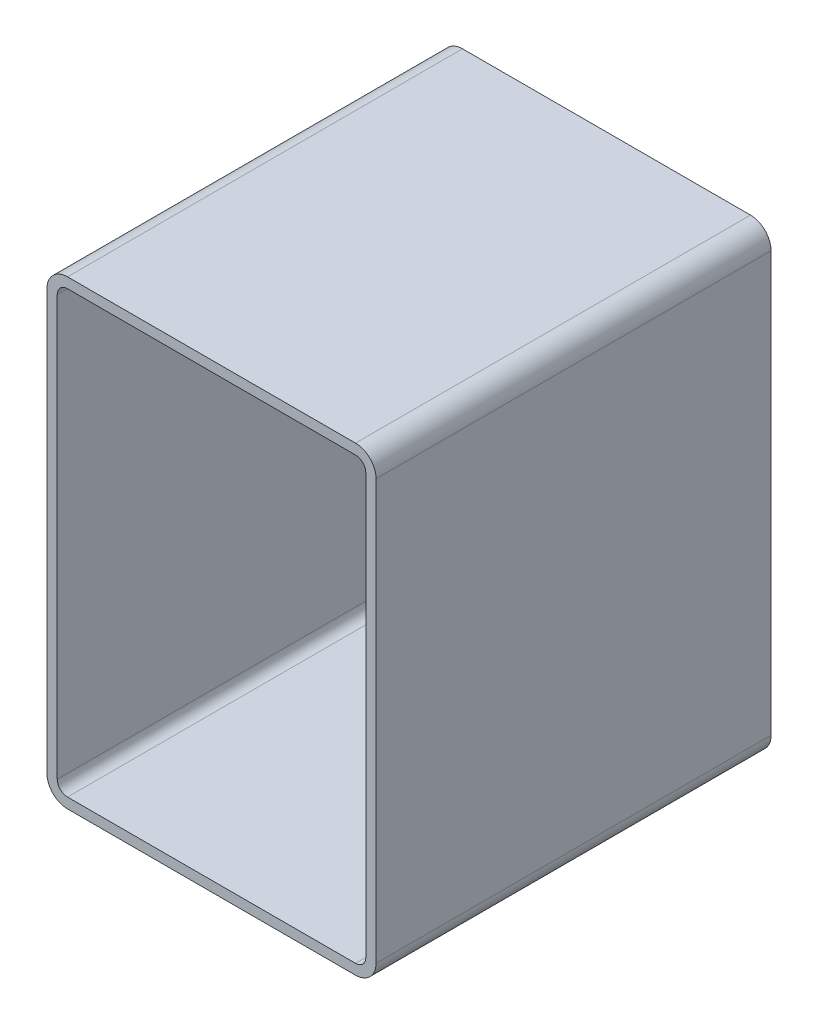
ISO-10303-21;
HEADER;
FILE_DESCRIPTION(('STEP AP214'),'2;1');
FILE_NAME('part.step','',(''),(''),'','','');
FILE_SCHEMA(('AUTOMOTIVE_DESIGN { 1 0 10303 214 1 1 1 1 }'));
ENDSEC;
DATA;
#1=APPLICATION_CONTEXT('core data for automotive mechanical design processes');
#2=APPLICATION_PROTOCOL_DEFINITION('international standard','automotive_design',2000,#1);
#3=PRODUCT_CONTEXT('',#1,'mechanical');
#4=PRODUCT('Part','Part','',(#3));
#5=PRODUCT_RELATED_PRODUCT_CATEGORY('part','',(#4));
#6=PRODUCT_DEFINITION_FORMATION('','',#4);
#7=PRODUCT_DEFINITION_CONTEXT('part definition',#1,'design');
#8=PRODUCT_DEFINITION('design','',#6,#7);
#9=PRODUCT_DEFINITION_SHAPE('','',#8);
#10=(LENGTH_UNIT() NAMED_UNIT(*) SI_UNIT(.MILLI.,.METRE.));
#11=(NAMED_UNIT(*) PLANE_ANGLE_UNIT() SI_UNIT($,.RADIAN.));
#12=(NAMED_UNIT(*) SI_UNIT($,.STERADIAN.) SOLID_ANGLE_UNIT());
#13=UNCERTAINTY_MEASURE_WITH_UNIT(LENGTH_MEASURE(1.E-05),#10,'distance_accuracy_value','');
#14=(GEOMETRIC_REPRESENTATION_CONTEXT(3) GLOBAL_UNCERTAINTY_ASSIGNED_CONTEXT((#13)) GLOBAL_UNIT_ASSIGNED_CONTEXT((#10,
#11,#12)) REPRESENTATION_CONTEXT('',''));
#15=CARTESIAN_POINT('',(0.,0.,0.));
#16=DIRECTION('',(0.,0.,1.));
#17=DIRECTION('',(1.,0.,0.));
#18=AXIS2_PLACEMENT_3D('',#15,#16,#17);
#19=CARTESIAN_POINT('',(18.6095794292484,341.553679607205,304.8));
#20=DIRECTION('',(0.,0.,1.));
#21=DIRECTION('',(1.,0.,0.));
#22=AXIS2_PLACEMENT_3D('',#19,#20,#21);
#23=PLANE('',#22);
#24=CARTESIAN_POINT('',(18.6095794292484,341.553679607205,304.8));
#25=DIRECTION('',(0.,0.,1.));
#26=DIRECTION('',(1.,0.,0.));
#27=AXIS2_PLACEMENT_3D('',#24,#25,#26);
#28=CIRCLE('',#27,15.875);
#29=CARTESIAN_POINT('',(18.6095794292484,357.428679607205,304.8));
#30=VERTEX_POINT('',#29);
#31=CARTESIAN_POINT('',(2.73457942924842,341.553679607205,304.8));
#32=VERTEX_POINT('',#31);
#33=EDGE_CURVE('E211',#30,#32,#28,.T.);
#34=ORIENTED_EDGE('',*,*,#33,.T.);
#35=DIRECTION('',(0.,-1.,0.));
#36=VECTOR('',#35,1.);
#37=CARTESIAN_POINT('',(2.73457942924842,17.7036796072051,304.8));
#38=LINE('',#37,#36);
#39=CARTESIAN_POINT('',(2.73457942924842,17.7036796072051,304.8));
#40=VERTEX_POINT('',#39);
#41=EDGE_CURVE('E214',#32,#40,#38,.T.);
#42=ORIENTED_EDGE('',*,*,#41,.T.);
#43=CARTESIAN_POINT('',(18.6095794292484,17.7036796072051,304.8));
#44=DIRECTION('',(0.,0.,1.));
#45=DIRECTION('',(1.,0.,0.));
#46=AXIS2_PLACEMENT_3D('',#43,#44,#45);
#47=CIRCLE('',#46,15.875);
#48=CARTESIAN_POINT('',(18.6095794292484,1.82867960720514,304.8));
#49=VERTEX_POINT('',#48);
#50=EDGE_CURVE('E217',#40,#49,#47,.T.);
#51=ORIENTED_EDGE('',*,*,#50,.T.);
#52=DIRECTION('',(1.,0.,0.));
#53=VECTOR('',#52,1.);
#54=CARTESIAN_POINT('',(240.859579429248,1.82867960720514,304.8));
#55=LINE('',#54,#53);
#56=CARTESIAN_POINT('',(240.859579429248,1.82867960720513,304.8));
#57=VERTEX_POINT('',#56);
#58=EDGE_CURVE('E219',#49,#57,#55,.T.);
#59=ORIENTED_EDGE('',*,*,#58,.T.);
#60=CARTESIAN_POINT('',(240.859579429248,17.7036796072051,304.8));
#61=DIRECTION('',(0.,0.,1.));
#62=DIRECTION('',(1.,0.,0.));
#63=AXIS2_PLACEMENT_3D('',#60,#61,#62);
#64=CIRCLE('',#63,15.875);
#65=CARTESIAN_POINT('',(256.734579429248,17.7036796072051,304.8));
#66=VERTEX_POINT('',#65);
#67=EDGE_CURVE('E221',#57,#66,#64,.T.);
#68=ORIENTED_EDGE('',*,*,#67,.T.);
#69=DIRECTION('',(0.,1.,0.));
#70=VECTOR('',#69,1.);
#71=CARTESIAN_POINT('',(256.734579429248,341.553679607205,304.8));
#72=LINE('',#71,#70);
#73=CARTESIAN_POINT('',(256.734579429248,341.553679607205,304.8));
#74=VERTEX_POINT('',#73);
#75=EDGE_CURVE('E223',#66,#74,#72,.T.);
#76=ORIENTED_EDGE('',*,*,#75,.T.);
#77=CARTESIAN_POINT('',(240.859579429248,341.553679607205,304.8));
#78=DIRECTION('',(0.,0.,1.));
#79=DIRECTION('',(1.,0.,0.));
#80=AXIS2_PLACEMENT_3D('',#77,#78,#79);
#81=CIRCLE('',#80,15.875);
#82=CARTESIAN_POINT('',(240.859579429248,357.428679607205,304.8));
#83=VERTEX_POINT('',#82);
#84=EDGE_CURVE('E225',#74,#83,#81,.T.);
#85=ORIENTED_EDGE('',*,*,#84,.T.);
#86=DIRECTION('',(-1.,0.,0.));
#87=VECTOR('',#86,1.);
#88=CARTESIAN_POINT('',(18.6095794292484,357.428679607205,304.8));
#89=LINE('',#88,#87);
#90=EDGE_CURVE('E227',#83,#30,#89,.T.);
#91=ORIENTED_EDGE('',*,*,#90,.T.);
#92=EDGE_LOOP('',(#34,#42,#51,#59,#68,#76,#85,#91));
#93=FACE_BOUND('',#92,.T.);
#94=DIRECTION('',(0.,-1.,0.));
#95=VECTOR('',#94,1.);
#96=CARTESIAN_POINT('',(10.6720794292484,17.7036796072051,304.8));
#97=LINE('',#96,#95);
#98=CARTESIAN_POINT('',(10.6720794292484,341.553679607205,304.8));
#99=VERTEX_POINT('',#98);
#100=CARTESIAN_POINT('',(10.6720794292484,17.7036796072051,304.8));
#101=VERTEX_POINT('',#100);
#102=EDGE_CURVE('E154',#99,#101,#97,.T.);
#103=ORIENTED_EDGE('',*,*,#102,.F.);
#104=CARTESIAN_POINT('',(18.6095794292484,341.553679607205,304.8));
#105=DIRECTION('',(0.,0.,1.));
#106=DIRECTION('',(1.,0.,0.));
#107=AXIS2_PLACEMENT_3D('',#104,#105,#106);
#108=CIRCLE('',#107,7.93749999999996);
#109=CARTESIAN_POINT('',(18.6095794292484,349.491179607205,304.8));
#110=VERTEX_POINT('',#109);
#111=EDGE_CURVE('E146',#110,#99,#108,.T.);
#112=ORIENTED_EDGE('',*,*,#111,.F.);
#113=DIRECTION('',(-1.,0.,0.));
#114=VECTOR('',#113,1.);
#115=CARTESIAN_POINT('',(18.6095794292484,349.491179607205,304.8));
#116=LINE('',#115,#114);
#117=CARTESIAN_POINT('',(240.859579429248,349.491179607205,304.8));
#118=VERTEX_POINT('',#117);
#119=EDGE_CURVE('E179',#118,#110,#116,.T.);
#120=ORIENTED_EDGE('',*,*,#119,.F.);
#121=CARTESIAN_POINT('',(240.859579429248,341.553679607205,304.8));
#122=DIRECTION('',(0.,0.,1.));
#123=DIRECTION('',(1.,0.,0.));
#124=AXIS2_PLACEMENT_3D('',#121,#122,#123);
#125=CIRCLE('',#124,7.93749999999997);
#126=CARTESIAN_POINT('',(248.797079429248,341.553679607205,304.8));
#127=VERTEX_POINT('',#126);
#128=EDGE_CURVE('E177',#127,#118,#125,.T.);
#129=ORIENTED_EDGE('',*,*,#128,.F.);
#130=DIRECTION('',(0.,1.,0.));
#131=VECTOR('',#130,1.);
#132=CARTESIAN_POINT('',(248.797079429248,341.553679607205,304.8));
#133=LINE('',#132,#131);
#134=CARTESIAN_POINT('',(248.797079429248,17.7036796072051,304.8));
#135=VERTEX_POINT('',#134);
#136=EDGE_CURVE('E175',#135,#127,#133,.T.);
#137=ORIENTED_EDGE('',*,*,#136,.F.);
#138=CARTESIAN_POINT('',(240.859579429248,17.7036796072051,304.8));
#139=DIRECTION('',(0.,0.,1.));
#140=DIRECTION('',(1.,0.,0.));
#141=AXIS2_PLACEMENT_3D('',#138,#139,#140);
#142=CIRCLE('',#141,7.93750000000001);
#143=CARTESIAN_POINT('',(240.859579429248,9.76617960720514,304.8));
#144=VERTEX_POINT('',#143);
#145=EDGE_CURVE('E173',#144,#135,#142,.T.);
#146=ORIENTED_EDGE('',*,*,#145,.F.);
#147=DIRECTION('',(1.,0.,0.));
#148=VECTOR('',#147,1.);
#149=CARTESIAN_POINT('',(240.859579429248,9.76617960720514,304.8));
#150=LINE('',#149,#148);
#151=CARTESIAN_POINT('',(18.6095794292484,9.76617960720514,304.8));
#152=VERTEX_POINT('',#151);
#153=EDGE_CURVE('E169',#152,#144,#150,.T.);
#154=ORIENTED_EDGE('',*,*,#153,.F.);
#155=CARTESIAN_POINT('',(18.6095794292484,17.7036796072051,304.8));
#156=DIRECTION('',(0.,0.,1.));
#157=DIRECTION('',(1.,0.,0.));
#158=AXIS2_PLACEMENT_3D('',#155,#156,#157);
#159=CIRCLE('',#158,7.9375);
#160=EDGE_CURVE('E167',#101,#152,#159,.T.);
#161=ORIENTED_EDGE('',*,*,#160,.F.);
#162=EDGE_LOOP('',(#103,#112,#120,#129,#137,#146,#154,#161));
#163=FACE_BOUND('',#162,.T.);
#164=ADVANCED_FACE('F33',(#93,#163),#23,.T.);
#165=CARTESIAN_POINT('',(18.6095794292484,341.553679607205,0.));
#166=DIRECTION('',(0.,0.,1.));
#167=DIRECTION('',(1.,0.,0.));
#168=AXIS2_PLACEMENT_3D('',#165,#166,#167);
#169=PLANE('',#168);
#170=CARTESIAN_POINT('',(18.6095794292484,341.553679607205,0.));
#171=DIRECTION('',(0.,0.,1.));
#172=DIRECTION('',(1.,0.,0.));
#173=AXIS2_PLACEMENT_3D('',#170,#171,#172);
#174=CIRCLE('',#173,15.875);
#175=CARTESIAN_POINT('',(18.6095794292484,357.428679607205,0.));
#176=VERTEX_POINT('',#175);
#177=CARTESIAN_POINT('',(2.73457942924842,341.553679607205,0.));
#178=VERTEX_POINT('',#177);
#179=EDGE_CURVE('E162',#176,#178,#174,.T.);
#180=ORIENTED_EDGE('',*,*,#179,.F.);
#181=DIRECTION('',(-1.,0.,0.));
#182=VECTOR('',#181,1.);
#183=CARTESIAN_POINT('',(18.6095794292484,357.428679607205,0.));
#184=LINE('',#183,#182);
#185=CARTESIAN_POINT('',(240.859579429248,357.428679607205,0.));
#186=VERTEX_POINT('',#185);
#187=EDGE_CURVE('E215',#186,#176,#184,.T.);
#188=ORIENTED_EDGE('',*,*,#187,.F.);
#189=CARTESIAN_POINT('',(240.859579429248,341.553679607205,0.));
#190=DIRECTION('',(0.,0.,1.));
#191=DIRECTION('',(1.,0.,0.));
#192=AXIS2_PLACEMENT_3D('',#189,#190,#191);
#193=CIRCLE('',#192,15.875);
#194=CARTESIAN_POINT('',(256.734579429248,341.553679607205,0.));
#195=VERTEX_POINT('',#194);
#196=EDGE_CURVE('E242',#195,#186,#193,.T.);
#197=ORIENTED_EDGE('',*,*,#196,.F.);
#198=DIRECTION('',(0.,1.,0.));
#199=VECTOR('',#198,1.);
#200=CARTESIAN_POINT('',(256.734579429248,341.553679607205,0.));
#201=LINE('',#200,#199);
#202=CARTESIAN_POINT('',(256.734579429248,17.7036796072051,0.));
#203=VERTEX_POINT('',#202);
#204=EDGE_CURVE('E240',#203,#195,#201,.T.);
#205=ORIENTED_EDGE('',*,*,#204,.F.);
#206=CARTESIAN_POINT('',(240.859579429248,17.7036796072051,0.));
#207=DIRECTION('',(0.,0.,1.));
#208=DIRECTION('',(1.,0.,0.));
#209=AXIS2_PLACEMENT_3D('',#206,#207,#208);
#210=CIRCLE('',#209,15.875);
#211=CARTESIAN_POINT('',(240.859579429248,1.82867960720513,0.));
#212=VERTEX_POINT('',#211);
#213=EDGE_CURVE('E238',#212,#203,#210,.T.);
#214=ORIENTED_EDGE('',*,*,#213,.F.);
#215=DIRECTION('',(1.,0.,0.));
#216=VECTOR('',#215,1.);
#217=CARTESIAN_POINT('',(240.859579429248,1.82867960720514,0.));
#218=LINE('',#217,#216);
#219=CARTESIAN_POINT('',(18.6095794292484,1.82867960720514,0.));
#220=VERTEX_POINT('',#219);
#221=EDGE_CURVE('E236',#220,#212,#218,.T.);
#222=ORIENTED_EDGE('',*,*,#221,.F.);
#223=CARTESIAN_POINT('',(18.6095794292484,17.7036796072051,0.));
#224=DIRECTION('',(0.,0.,1.));
#225=DIRECTION('',(1.,0.,0.));
#226=AXIS2_PLACEMENT_3D('',#223,#224,#225);
#227=CIRCLE('',#226,15.875);
#228=CARTESIAN_POINT('',(2.73457942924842,17.7036796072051,0.));
#229=VERTEX_POINT('',#228);
#230=EDGE_CURVE('E234',#229,#220,#227,.T.);
#231=ORIENTED_EDGE('',*,*,#230,.F.);
#232=DIRECTION('',(0.,-1.,0.));
#233=VECTOR('',#232,1.);
#234=CARTESIAN_POINT('',(2.73457942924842,17.7036796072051,0.));
#235=LINE('',#234,#233);
#236=EDGE_CURVE('E232',#178,#229,#235,.T.);
#237=ORIENTED_EDGE('',*,*,#236,.F.);
#238=EDGE_LOOP('',(#180,#188,#197,#205,#214,#222,#231,#237));
#239=FACE_BOUND('',#238,.T.);
#240=CARTESIAN_POINT('',(18.6095794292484,341.553679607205,0.));
#241=DIRECTION('',(0.,0.,1.));
#242=DIRECTION('',(1.,0.,0.));
#243=AXIS2_PLACEMENT_3D('',#240,#241,#242);
#244=CIRCLE('',#243,7.93749999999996);
#245=CARTESIAN_POINT('',(18.6095794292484,349.491179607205,0.));
#246=VERTEX_POINT('',#245);
#247=CARTESIAN_POINT('',(10.6720794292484,341.553679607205,0.));
#248=VERTEX_POINT('',#247);
#249=EDGE_CURVE('E56',#246,#248,#244,.T.);
#250=ORIENTED_EDGE('',*,*,#249,.T.);
#251=DIRECTION('',(0.,-1.,0.));
#252=VECTOR('',#251,1.);
#253=CARTESIAN_POINT('',(10.6720794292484,17.7036796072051,0.));
#254=LINE('',#253,#252);
#255=CARTESIAN_POINT('',(10.6720794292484,17.7036796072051,0.));
#256=VERTEX_POINT('',#255);
#257=EDGE_CURVE('E161',#248,#256,#254,.T.);
#258=ORIENTED_EDGE('',*,*,#257,.T.);
#259=CARTESIAN_POINT('',(18.6095794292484,17.7036796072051,0.));
#260=DIRECTION('',(0.,0.,1.));
#261=DIRECTION('',(1.,0.,0.));
#262=AXIS2_PLACEMENT_3D('',#259,#260,#261);
#263=CIRCLE('',#262,7.9375);
#264=CARTESIAN_POINT('',(18.6095794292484,9.76617960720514,0.));
#265=VERTEX_POINT('',#264);
#266=EDGE_CURVE('E183',#256,#265,#263,.T.);
#267=ORIENTED_EDGE('',*,*,#266,.T.);
#268=DIRECTION('',(1.,0.,0.));
#269=VECTOR('',#268,1.);
#270=CARTESIAN_POINT('',(240.859579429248,9.76617960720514,0.));
#271=LINE('',#270,#269);
#272=CARTESIAN_POINT('',(240.859579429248,9.76617960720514,0.));
#273=VERTEX_POINT('',#272);
#274=EDGE_CURVE('E186',#265,#273,#271,.T.);
#275=ORIENTED_EDGE('',*,*,#274,.T.);
#276=CARTESIAN_POINT('',(240.859579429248,17.7036796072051,0.));
#277=DIRECTION('',(0.,0.,1.));
#278=DIRECTION('',(1.,0.,0.));
#279=AXIS2_PLACEMENT_3D('',#276,#277,#278);
#280=CIRCLE('',#279,7.93750000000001);
#281=CARTESIAN_POINT('',(248.797079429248,17.7036796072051,0.));
#282=VERTEX_POINT('',#281);
#283=EDGE_CURVE('E189',#273,#282,#280,.T.);
#284=ORIENTED_EDGE('',*,*,#283,.T.);
#285=DIRECTION('',(0.,1.,0.));
#286=VECTOR('',#285,1.);
#287=CARTESIAN_POINT('',(248.797079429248,341.553679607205,0.));
#288=LINE('',#287,#286);
#289=CARTESIAN_POINT('',(248.797079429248,341.553679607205,0.));
#290=VERTEX_POINT('',#289);
#291=EDGE_CURVE('E192',#282,#290,#288,.T.);
#292=ORIENTED_EDGE('',*,*,#291,.T.);
#293=CARTESIAN_POINT('',(240.859579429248,341.553679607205,0.));
#294=DIRECTION('',(0.,0.,1.));
#295=DIRECTION('',(1.,0.,0.));
#296=AXIS2_PLACEMENT_3D('',#293,#294,#295);
#297=CIRCLE('',#296,7.93749999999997);
#298=CARTESIAN_POINT('',(240.859579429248,349.491179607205,0.));
#299=VERTEX_POINT('',#298);
#300=EDGE_CURVE('E195',#290,#299,#297,.T.);
#301=ORIENTED_EDGE('',*,*,#300,.T.);
#302=DIRECTION('',(-1.,0.,0.));
#303=VECTOR('',#302,1.);
#304=CARTESIAN_POINT('',(18.6095794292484,349.491179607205,0.));
#305=LINE('',#304,#303);
#306=EDGE_CURVE('E155',#299,#246,#305,.T.);
#307=ORIENTED_EDGE('',*,*,#306,.T.);
#308=EDGE_LOOP('',(#250,#258,#267,#275,#284,#292,#301,#307));
#309=FACE_BOUND('',#308,.T.);
#310=ADVANCED_FACE('F272',(#239,#309),#169,.F.);
#311=CARTESIAN_POINT('',(18.6095794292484,341.553679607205,304.8));
#312=DIRECTION('',(0.,0.,-1.));
#313=DIRECTION('',(-1.,0.,0.));
#314=AXIS2_PLACEMENT_3D('',#311,#312,#313);
#315=CYLINDRICAL_SURFACE('',#314,15.875);
#316=ORIENTED_EDGE('',*,*,#179,.T.);
#317=DIRECTION('',(0.,0.,-1.));
#318=VECTOR('',#317,1.);
#319=CARTESIAN_POINT('',(2.73457942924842,341.553679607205,304.8));
#320=LINE('',#319,#318);
#321=EDGE_CURVE('E11',#32,#178,#320,.T.);
#322=ORIENTED_EDGE('',*,*,#321,.F.);
#323=ORIENTED_EDGE('',*,*,#33,.F.);
#324=DIRECTION('',(0.,0.,-1.));
#325=VECTOR('',#324,1.);
#326=CARTESIAN_POINT('',(18.6095794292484,357.428679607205,304.8));
#327=LINE('',#326,#325);
#328=EDGE_CURVE('E229',#30,#176,#327,.T.);
#329=ORIENTED_EDGE('',*,*,#328,.T.);
#330=EDGE_LOOP('',(#316,#322,#323,#329));
#331=FACE_BOUND('',#330,.T.);
#332=ADVANCED_FACE('F35',(#331),#315,.T.);
#333=CARTESIAN_POINT('',(2.73457942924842,17.7036796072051,304.8));
#334=DIRECTION('',(1.,0.,0.));
#335=DIRECTION('',(0.,0.,-1.));
#336=AXIS2_PLACEMENT_3D('',#333,#334,#335);
#337=PLANE('',#336);
#338=ORIENTED_EDGE('',*,*,#236,.T.);
#339=DIRECTION('',(0.,0.,-1.));
#340=VECTOR('',#339,1.);
#341=CARTESIAN_POINT('',(2.73457942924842,17.7036796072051,304.8));
#342=LINE('',#341,#340);
#343=EDGE_CURVE('E41',#40,#229,#342,.T.);
#344=ORIENTED_EDGE('',*,*,#343,.F.);
#345=ORIENTED_EDGE('',*,*,#41,.F.);
#346=ORIENTED_EDGE('',*,*,#321,.T.);
#347=EDGE_LOOP('',(#338,#344,#345,#346));
#348=FACE_BOUND('',#347,.T.);
#349=ADVANCED_FACE('F289',(#348),#337,.F.);
#350=CARTESIAN_POINT('',(18.6095794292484,17.7036796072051,304.8));
#351=DIRECTION('',(0.,0.,-1.));
#352=DIRECTION('',(-1.,0.,0.));
#353=AXIS2_PLACEMENT_3D('',#350,#351,#352);
#354=CYLINDRICAL_SURFACE('',#353,15.875);
#355=ORIENTED_EDGE('',*,*,#230,.T.);
#356=DIRECTION('',(0.,0.,-1.));
#357=VECTOR('',#356,1.);
#358=CARTESIAN_POINT('',(18.6095794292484,1.82867960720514,304.8));
#359=LINE('',#358,#357);
#360=EDGE_CURVE('E259',#49,#220,#359,.T.);
#361=ORIENTED_EDGE('',*,*,#360,.F.);
#362=ORIENTED_EDGE('',*,*,#50,.F.);
#363=ORIENTED_EDGE('',*,*,#343,.T.);
#364=EDGE_LOOP('',(#355,#361,#362,#363));
#365=FACE_BOUND('',#364,.T.);
#366=ADVANCED_FACE('F266',(#365),#354,.T.);
#367=CARTESIAN_POINT('',(240.859579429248,1.82867960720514,304.8));
#368=DIRECTION('',(0.,1.,0.));
#369=DIRECTION('',(0.,0.,1.));
#370=AXIS2_PLACEMENT_3D('',#367,#368,#369);
#371=PLANE('',#370);
#372=ORIENTED_EDGE('',*,*,#221,.T.);
#373=DIRECTION('',(0.,0.,-1.));
#374=VECTOR('',#373,1.);
#375=CARTESIAN_POINT('',(240.859579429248,1.82867960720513,304.8));
#376=LINE('',#375,#374);
#377=EDGE_CURVE('E256',#57,#212,#376,.T.);
#378=ORIENTED_EDGE('',*,*,#377,.F.);
#379=ORIENTED_EDGE('',*,*,#58,.F.);
#380=ORIENTED_EDGE('',*,*,#360,.T.);
#381=EDGE_LOOP('',(#372,#378,#379,#380));
#382=FACE_BOUND('',#381,.T.);
#383=ADVANCED_FACE('F278',(#382),#371,.F.);
#384=CARTESIAN_POINT('',(240.859579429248,17.7036796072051,304.8));
#385=DIRECTION('',(0.,0.,-1.));
#386=DIRECTION('',(-1.,0.,0.));
#387=AXIS2_PLACEMENT_3D('',#384,#385,#386);
#388=CYLINDRICAL_SURFACE('',#387,15.875);
#389=ORIENTED_EDGE('',*,*,#213,.T.);
#390=DIRECTION('',(0.,0.,-1.));
#391=VECTOR('',#390,1.);
#392=CARTESIAN_POINT('',(256.734579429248,17.7036796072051,304.8));
#393=LINE('',#392,#391);
#394=EDGE_CURVE('E253',#66,#203,#393,.T.);
#395=ORIENTED_EDGE('',*,*,#394,.F.);
#396=ORIENTED_EDGE('',*,*,#67,.F.);
#397=ORIENTED_EDGE('',*,*,#377,.T.);
#398=EDGE_LOOP('',(#389,#395,#396,#397));
#399=FACE_BOUND('',#398,.T.);
#400=ADVANCED_FACE('F282',(#399),#388,.T.);
#401=CARTESIAN_POINT('',(256.734579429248,341.553679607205,304.8));
#402=DIRECTION('',(-1.,0.,0.));
#403=DIRECTION('',(0.,0.,1.));
#404=AXIS2_PLACEMENT_3D('',#401,#402,#403);
#405=PLANE('',#404);
#406=ORIENTED_EDGE('',*,*,#204,.T.);
#407=DIRECTION('',(0.,0.,-1.));
#408=VECTOR('',#407,1.);
#409=CARTESIAN_POINT('',(256.734579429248,341.553679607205,304.8));
#410=LINE('',#409,#408);
#411=EDGE_CURVE('E250',#74,#195,#410,.T.);
#412=ORIENTED_EDGE('',*,*,#411,.F.);
#413=ORIENTED_EDGE('',*,*,#75,.F.);
#414=ORIENTED_EDGE('',*,*,#394,.T.);
#415=EDGE_LOOP('',(#406,#412,#413,#414));
#416=FACE_BOUND('',#415,.T.);
#417=ADVANCED_FACE('F302',(#416),#405,.F.);
#418=CARTESIAN_POINT('',(240.859579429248,341.553679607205,304.8));
#419=DIRECTION('',(0.,0.,-1.));
#420=DIRECTION('',(-1.,0.,0.));
#421=AXIS2_PLACEMENT_3D('',#418,#419,#420);
#422=CYLINDRICAL_SURFACE('',#421,15.875);
#423=ORIENTED_EDGE('',*,*,#196,.T.);
#424=DIRECTION('',(0.,0.,-1.));
#425=VECTOR('',#424,1.);
#426=CARTESIAN_POINT('',(240.859579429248,357.428679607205,304.8));
#427=LINE('',#426,#425);
#428=EDGE_CURVE('E247',#83,#186,#427,.T.);
#429=ORIENTED_EDGE('',*,*,#428,.F.);
#430=ORIENTED_EDGE('',*,*,#84,.F.);
#431=ORIENTED_EDGE('',*,*,#411,.T.);
#432=EDGE_LOOP('',(#423,#429,#430,#431));
#433=FACE_BOUND('',#432,.T.);
#434=ADVANCED_FACE('F300',(#433),#422,.T.);
#435=CARTESIAN_POINT('',(18.6095794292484,357.428679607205,304.8));
#436=DIRECTION('',(0.,-1.,0.));
#437=DIRECTION('',(0.,0.,-1.));
#438=AXIS2_PLACEMENT_3D('',#435,#436,#437);
#439=PLANE('',#438);
#440=ORIENTED_EDGE('',*,*,#187,.T.);
#441=ORIENTED_EDGE('',*,*,#328,.F.);
#442=ORIENTED_EDGE('',*,*,#90,.F.);
#443=ORIENTED_EDGE('',*,*,#428,.T.);
#444=EDGE_LOOP('',(#440,#441,#442,#443));
#445=FACE_BOUND('',#444,.T.);
#446=ADVANCED_FACE('F295',(#445),#439,.F.);
#447=CARTESIAN_POINT('',(18.6095794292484,341.553679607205,304.8));
#448=DIRECTION('',(0.,0.,-1.));
#449=DIRECTION('',(-1.,0.,0.));
#450=AXIS2_PLACEMENT_3D('',#447,#448,#449);
#451=CYLINDRICAL_SURFACE('',#450,7.93749999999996);
#452=ORIENTED_EDGE('',*,*,#249,.F.);
#453=DIRECTION('',(0.,0.,-1.));
#454=VECTOR('',#453,1.);
#455=CARTESIAN_POINT('',(18.6095794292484,349.491179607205,304.8));
#456=LINE('',#455,#454);
#457=EDGE_CURVE('E150',#110,#246,#456,.T.);
#458=ORIENTED_EDGE('',*,*,#457,.F.);
#459=ORIENTED_EDGE('',*,*,#111,.T.);
#460=DIRECTION('',(0.,0.,-1.));
#461=VECTOR('',#460,1.);
#462=CARTESIAN_POINT('',(10.6720794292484,341.553679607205,304.8));
#463=LINE('',#462,#461);
#464=EDGE_CURVE('E149',#99,#248,#463,.T.);
#465=ORIENTED_EDGE('',*,*,#464,.T.);
#466=EDGE_LOOP('',(#452,#458,#459,#465));
#467=FACE_BOUND('',#466,.T.);
#468=ADVANCED_FACE('F148',(#467),#451,.F.);
#469=CARTESIAN_POINT('',(10.6720794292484,17.7036796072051,304.8));
#470=DIRECTION('',(1.,0.,0.));
#471=DIRECTION('',(0.,0.,-1.));
#472=AXIS2_PLACEMENT_3D('',#469,#470,#471);
#473=PLANE('',#472);
#474=ORIENTED_EDGE('',*,*,#257,.F.);
#475=ORIENTED_EDGE('',*,*,#464,.F.);
#476=ORIENTED_EDGE('',*,*,#102,.T.);
#477=DIRECTION('',(0.,0.,-1.));
#478=VECTOR('',#477,1.);
#479=CARTESIAN_POINT('',(10.6720794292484,17.7036796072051,304.8));
#480=LINE('',#479,#478);
#481=EDGE_CURVE('E163',#101,#256,#480,.T.);
#482=ORIENTED_EDGE('',*,*,#481,.T.);
#483=EDGE_LOOP('',(#474,#475,#476,#482));
#484=FACE_BOUND('',#483,.T.);
#485=ADVANCED_FACE('F158',(#484),#473,.T.);
#486=CARTESIAN_POINT('',(18.6095794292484,17.7036796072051,304.8));
#487=DIRECTION('',(0.,0.,-1.));
#488=DIRECTION('',(-1.,0.,0.));
#489=AXIS2_PLACEMENT_3D('',#486,#487,#488);
#490=CYLINDRICAL_SURFACE('',#489,7.9375);
#491=ORIENTED_EDGE('',*,*,#266,.F.);
#492=ORIENTED_EDGE('',*,*,#481,.F.);
#493=ORIENTED_EDGE('',*,*,#160,.T.);
#494=DIRECTION('',(0.,0.,-1.));
#495=VECTOR('',#494,1.);
#496=CARTESIAN_POINT('',(18.6095794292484,9.76617960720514,304.8));
#497=LINE('',#496,#495);
#498=EDGE_CURVE('E208',#152,#265,#497,.T.);
#499=ORIENTED_EDGE('',*,*,#498,.T.);
#500=EDGE_LOOP('',(#491,#492,#493,#499));
#501=FACE_BOUND('',#500,.T.);
#502=ADVANCED_FACE('F327',(#501),#490,.F.);
#503=CARTESIAN_POINT('',(240.859579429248,9.76617960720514,304.8));
#504=DIRECTION('',(0.,1.,0.));
#505=DIRECTION('',(0.,0.,1.));
#506=AXIS2_PLACEMENT_3D('',#503,#504,#505);
#507=PLANE('',#506);
#508=ORIENTED_EDGE('',*,*,#274,.F.);
#509=ORIENTED_EDGE('',*,*,#498,.F.);
#510=ORIENTED_EDGE('',*,*,#153,.T.);
#511=DIRECTION('',(0.,0.,-1.));
#512=VECTOR('',#511,1.);
#513=CARTESIAN_POINT('',(240.859579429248,9.76617960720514,304.8));
#514=LINE('',#513,#512);
#515=EDGE_CURVE('E206',#144,#273,#514,.T.);
#516=ORIENTED_EDGE('',*,*,#515,.T.);
#517=EDGE_LOOP('',(#508,#509,#510,#516));
#518=FACE_BOUND('',#517,.T.);
#519=ADVANCED_FACE('F331',(#518),#507,.T.);
#520=CARTESIAN_POINT('',(240.859579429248,17.7036796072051,304.8));
#521=DIRECTION('',(0.,0.,-1.));
#522=DIRECTION('',(-1.,0.,0.));
#523=AXIS2_PLACEMENT_3D('',#520,#521,#522);
#524=CYLINDRICAL_SURFACE('',#523,7.93750000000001);
#525=ORIENTED_EDGE('',*,*,#283,.F.);
#526=ORIENTED_EDGE('',*,*,#515,.F.);
#527=ORIENTED_EDGE('',*,*,#145,.T.);
#528=DIRECTION('',(0.,0.,-1.));
#529=VECTOR('',#528,1.);
#530=CARTESIAN_POINT('',(248.797079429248,17.7036796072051,304.8));
#531=LINE('',#530,#529);
#532=EDGE_CURVE('E204',#135,#282,#531,.T.);
#533=ORIENTED_EDGE('',*,*,#532,.T.);
#534=EDGE_LOOP('',(#525,#526,#527,#533));
#535=FACE_BOUND('',#534,.T.);
#536=ADVANCED_FACE('F337',(#535),#524,.F.);
#537=CARTESIAN_POINT('',(248.797079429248,341.553679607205,304.8));
#538=DIRECTION('',(-1.,0.,0.));
#539=DIRECTION('',(0.,0.,1.));
#540=AXIS2_PLACEMENT_3D('',#537,#538,#539);
#541=PLANE('',#540);
#542=ORIENTED_EDGE('',*,*,#291,.F.);
#543=ORIENTED_EDGE('',*,*,#532,.F.);
#544=ORIENTED_EDGE('',*,*,#136,.T.);
#545=DIRECTION('',(0.,0.,-1.));
#546=VECTOR('',#545,1.);
#547=CARTESIAN_POINT('',(248.797079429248,341.553679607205,304.8));
#548=LINE('',#547,#546);
#549=EDGE_CURVE('E202',#127,#290,#548,.T.);
#550=ORIENTED_EDGE('',*,*,#549,.T.);
#551=EDGE_LOOP('',(#542,#543,#544,#550));
#552=FACE_BOUND('',#551,.T.);
#553=ADVANCED_FACE('F341',(#552),#541,.T.);
#554=CARTESIAN_POINT('',(240.859579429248,341.553679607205,304.8));
#555=DIRECTION('',(0.,0.,-1.));
#556=DIRECTION('',(-1.,0.,0.));
#557=AXIS2_PLACEMENT_3D('',#554,#555,#556);
#558=CYLINDRICAL_SURFACE('',#557,7.93749999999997);
#559=ORIENTED_EDGE('',*,*,#300,.F.);
#560=ORIENTED_EDGE('',*,*,#549,.F.);
#561=ORIENTED_EDGE('',*,*,#128,.T.);
#562=DIRECTION('',(0.,0.,-1.));
#563=VECTOR('',#562,1.);
#564=CARTESIAN_POINT('',(240.859579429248,349.491179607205,304.8));
#565=LINE('',#564,#563);
#566=EDGE_CURVE('E48',#118,#299,#565,.T.);
#567=ORIENTED_EDGE('',*,*,#566,.T.);
#568=EDGE_LOOP('',(#559,#560,#561,#567));
#569=FACE_BOUND('',#568,.T.);
#570=ADVANCED_FACE('F345',(#569),#558,.F.);
#571=CARTESIAN_POINT('',(18.6095794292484,349.491179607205,304.8));
#572=DIRECTION('',(0.,-1.,0.));
#573=DIRECTION('',(0.,0.,-1.));
#574=AXIS2_PLACEMENT_3D('',#571,#572,#573);
#575=PLANE('',#574);
#576=ORIENTED_EDGE('',*,*,#306,.F.);
#577=ORIENTED_EDGE('',*,*,#566,.F.);
#578=ORIENTED_EDGE('',*,*,#119,.T.);
#579=ORIENTED_EDGE('',*,*,#457,.T.);
#580=EDGE_LOOP('',(#576,#577,#578,#579));
#581=FACE_BOUND('',#580,.T.);
#582=ADVANCED_FACE('F349',(#581),#575,.T.);
#583=CLOSED_SHELL('',(#164,#310,#332,#349,#366,#383,#400,#417,#434,#446,#468,#485,#502,#519,
#536,#553,#570,#582));
#584=MANIFOLD_SOLID_BREP('B2',#583);
#585=ADVANCED_BREP_SHAPE_REPRESENTATION('',(#18,#584),#14);
#586=SHAPE_DEFINITION_REPRESENTATION(#9,#585);
ENDSEC;
END-ISO-10303-21;
